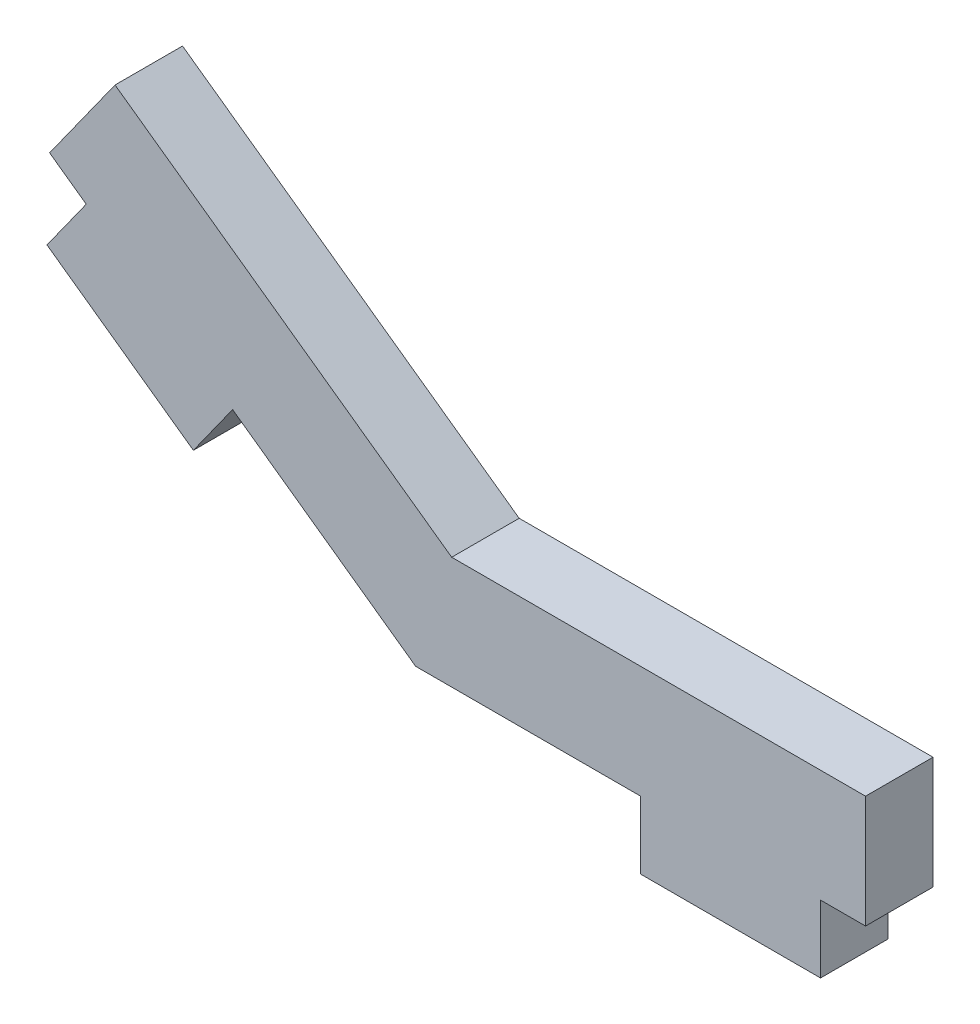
ISO-10303-21;
HEADER;
FILE_DESCRIPTION(('STEP AP214'),'2;1');
FILE_NAME('part.step','',(''),(''),'','','');
FILE_SCHEMA(('AUTOMOTIVE_DESIGN { 1 0 10303 214 1 1 1 1 }'));
ENDSEC;
DATA;
#1=APPLICATION_CONTEXT('core data for automotive mechanical design processes');
#2=APPLICATION_PROTOCOL_DEFINITION('international standard','automotive_design',2000,#1);
#3=PRODUCT_CONTEXT('',#1,'mechanical');
#4=PRODUCT('Part','Part','',(#3));
#5=PRODUCT_RELATED_PRODUCT_CATEGORY('part','',(#4));
#6=PRODUCT_DEFINITION_FORMATION('','',#4);
#7=PRODUCT_DEFINITION_CONTEXT('part definition',#1,'design');
#8=PRODUCT_DEFINITION('design','',#6,#7);
#9=PRODUCT_DEFINITION_SHAPE('','',#8);
#10=(LENGTH_UNIT() NAMED_UNIT(*) SI_UNIT(.MILLI.,.METRE.));
#11=(NAMED_UNIT(*) PLANE_ANGLE_UNIT() SI_UNIT($,.RADIAN.));
#12=(NAMED_UNIT(*) SI_UNIT($,.STERADIAN.) SOLID_ANGLE_UNIT());
#13=UNCERTAINTY_MEASURE_WITH_UNIT(LENGTH_MEASURE(1.E-05),#10,'distance_accuracy_value','');
#14=(GEOMETRIC_REPRESENTATION_CONTEXT(3) GLOBAL_UNCERTAINTY_ASSIGNED_CONTEXT((#13)) GLOBAL_UNIT_ASSIGNED_CONTEXT((#10,
#11,#12)) REPRESENTATION_CONTEXT('',''));
#15=CARTESIAN_POINT('',(0.,0.,0.));
#16=DIRECTION('',(0.,0.,1.));
#17=DIRECTION('',(1.,0.,0.));
#18=AXIS2_PLACEMENT_3D('',#15,#16,#17);
#19=CARTESIAN_POINT('',(0.,0.,3.));
#20=DIRECTION('',(0.581555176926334,0.813506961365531,0.));
#21=DIRECTION('',(-0.813506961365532,0.581555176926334,0.));
#22=AXIS2_PLACEMENT_3D('',#19,#20,#21);
#23=PLANE('',#22);
#24=DIRECTION('',(0.813506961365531,-0.581555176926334,0.));
#25=VECTOR('',#24,1.);
#26=CARTESIAN_POINT('',(0.,0.,0.));
#27=LINE('',#26,#25);
#28=CARTESIAN_POINT('',(-16.2701392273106,11.6311035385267,0.));
#29=VERTEX_POINT('',#28);
#30=CARTESIAN_POINT('',(-14.6431253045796,10.467993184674,0.));
#31=VERTEX_POINT('',#30);
#32=EDGE_CURVE('E215',#29,#31,#27,.T.);
#33=ORIENTED_EDGE('',*,*,#32,.T.);
#34=DIRECTION('',(0.,0.,1.));
#35=VECTOR('',#34,1.);
#36=CARTESIAN_POINT('',(-14.6431253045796,10.467993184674,0.));
#37=LINE('',#36,#35);
#38=CARTESIAN_POINT('',(-14.6431253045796,10.467993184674,3.));
#39=VERTEX_POINT('',#38);
#40=EDGE_CURVE('E58',#31,#39,#37,.T.);
#41=ORIENTED_EDGE('',*,*,#40,.T.);
#42=DIRECTION('',(0.813506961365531,-0.581555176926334,0.));
#43=VECTOR('',#42,1.);
#44=CARTESIAN_POINT('',(0.,0.,3.));
#45=LINE('',#44,#43);
#46=CARTESIAN_POINT('',(-16.2701392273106,11.6311035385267,3.));
#47=VERTEX_POINT('',#46);
#48=EDGE_CURVE('E200',#47,#39,#45,.T.);
#49=ORIENTED_EDGE('',*,*,#48,.F.);
#50=DIRECTION('',(0.,0.,-1.));
#51=VECTOR('',#50,1.);
#52=CARTESIAN_POINT('',(-16.2701392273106,11.6311035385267,3.));
#53=LINE('',#52,#51);
#54=EDGE_CURVE('E214',#47,#29,#53,.T.);
#55=ORIENTED_EDGE('',*,*,#54,.T.);
#56=EDGE_LOOP('',(#33,#41,#49,#55));
#57=FACE_BOUND('',#56,.T.);
#58=ADVANCED_FACE('F35',(#57),#23,.F.);
#59=CARTESIAN_POINT('',(0.,0.,3.));
#60=DIRECTION('',(0.,1.,0.));
#61=DIRECTION('',(0.,0.,1.));
#62=AXIS2_PLACEMENT_3D('',#59,#60,#61);
#63=PLANE('',#62);
#64=DIRECTION('',(0.,0.,1.));
#65=VECTOR('',#64,1.);
#66=CARTESIAN_POINT('',(18.,0.,0.));
#67=LINE('',#66,#65);
#68=CARTESIAN_POINT('',(18.,0.,0.));
#69=VERTEX_POINT('',#68);
#70=CARTESIAN_POINT('',(18.,0.,3.));
#71=VERTEX_POINT('',#70);
#72=EDGE_CURVE('E195',#69,#71,#67,.T.);
#73=ORIENTED_EDGE('',*,*,#72,.F.);
#74=DIRECTION('',(1.,0.,0.));
#75=VECTOR('',#74,1.);
#76=CARTESIAN_POINT('',(0.,0.,0.));
#77=LINE('',#76,#75);
#78=CARTESIAN_POINT('',(20.,0.,0.));
#79=VERTEX_POINT('',#78);
#80=EDGE_CURVE('E217',#69,#79,#77,.T.);
#81=ORIENTED_EDGE('',*,*,#80,.T.);
#82=DIRECTION('',(0.,0.,-1.));
#83=VECTOR('',#82,1.);
#84=CARTESIAN_POINT('',(20.,0.,3.));
#85=LINE('',#84,#83);
#86=CARTESIAN_POINT('',(20.,0.,3.));
#87=VERTEX_POINT('',#86);
#88=EDGE_CURVE('E43',#87,#79,#85,.T.);
#89=ORIENTED_EDGE('',*,*,#88,.F.);
#90=DIRECTION('',(1.,0.,0.));
#91=VECTOR('',#90,1.);
#92=CARTESIAN_POINT('',(0.,0.,3.));
#93=LINE('',#92,#91);
#94=EDGE_CURVE('E202',#71,#87,#93,.T.);
#95=ORIENTED_EDGE('',*,*,#94,.F.);
#96=EDGE_LOOP('',(#73,#81,#89,#95));
#97=FACE_BOUND('',#96,.T.);
#98=ADVANCED_FACE('F267',(#97),#63,.F.);
#99=CARTESIAN_POINT('',(-8.13506961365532,5.81555176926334,3.));
#100=VERTEX_POINT('',#99);
#101=CARTESIAN_POINT('',(0.,0.,3.));
#102=VERTEX_POINT('',#101);
#103=EDGE_CURVE('E50',#100,#102,#45,.T.);
#104=ORIENTED_EDGE('',*,*,#103,.F.);
#105=DIRECTION('',(0.,0.,1.));
#106=VECTOR('',#105,1.);
#107=CARTESIAN_POINT('',(-8.13506961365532,5.81555176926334,0.));
#108=LINE('',#107,#106);
#109=CARTESIAN_POINT('',(-8.13506961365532,5.81555176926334,0.));
#110=VERTEX_POINT('',#109);
#111=EDGE_CURVE('E171',#110,#100,#108,.T.);
#112=ORIENTED_EDGE('',*,*,#111,.F.);
#113=CARTESIAN_POINT('',(0.,0.,0.));
#114=VERTEX_POINT('',#113);
#115=EDGE_CURVE('E194',#110,#114,#27,.T.);
#116=ORIENTED_EDGE('',*,*,#115,.T.);
#117=DIRECTION('',(0.,0.,-1.));
#118=VECTOR('',#117,1.);
#119=CARTESIAN_POINT('',(0.,0.,3.));
#120=LINE('',#119,#118);
#121=EDGE_CURVE('E11',#102,#114,#120,.T.);
#122=ORIENTED_EDGE('',*,*,#121,.F.);
#123=EDGE_LOOP('',(#104,#112,#116,#122));
#124=FACE_BOUND('',#123,.T.);
#125=ADVANCED_FACE('F37',(#124),#23,.F.);
#126=CARTESIAN_POINT('',(10.,0.,0.));
#127=VERTEX_POINT('',#126);
#128=EDGE_CURVE('E218',#114,#127,#77,.T.);
#129=ORIENTED_EDGE('',*,*,#128,.T.);
#130=DIRECTION('',(0.,0.,1.));
#131=VECTOR('',#130,1.);
#132=CARTESIAN_POINT('',(10.,0.,0.));
#133=LINE('',#132,#131);
#134=CARTESIAN_POINT('',(10.,0.,3.));
#135=VERTEX_POINT('',#134);
#136=EDGE_CURVE('E191',#127,#135,#133,.T.);
#137=ORIENTED_EDGE('',*,*,#136,.T.);
#138=EDGE_CURVE('E203',#102,#135,#93,.T.);
#139=ORIENTED_EDGE('',*,*,#138,.F.);
#140=ORIENTED_EDGE('',*,*,#121,.T.);
#141=EDGE_LOOP('',(#129,#137,#139,#140));
#142=FACE_BOUND('',#141,.T.);
#143=ADVANCED_FACE('F279',(#142),#63,.F.);
#144=CARTESIAN_POINT('',(20.,5.,3.));
#145=DIRECTION('',(-1.,0.,0.));
#146=DIRECTION('',(0.,0.,1.));
#147=AXIS2_PLACEMENT_3D('',#144,#145,#146);
#148=PLANE('',#147);
#149=DIRECTION('',(0.,1.,0.));
#150=VECTOR('',#149,1.);
#151=CARTESIAN_POINT('',(20.,5.,0.));
#152=LINE('',#151,#150);
#153=CARTESIAN_POINT('',(20.,5.,0.));
#154=VERTEX_POINT('',#153);
#155=EDGE_CURVE('E221',#79,#154,#152,.T.);
#156=ORIENTED_EDGE('',*,*,#155,.T.);
#157=DIRECTION('',(0.,0.,-1.));
#158=VECTOR('',#157,1.);
#159=CARTESIAN_POINT('',(20.,5.,3.));
#160=LINE('',#159,#158);
#161=CARTESIAN_POINT('',(20.,5.,3.));
#162=VERTEX_POINT('',#161);
#163=EDGE_CURVE('E237',#162,#154,#160,.T.);
#164=ORIENTED_EDGE('',*,*,#163,.F.);
#165=DIRECTION('',(0.,1.,0.));
#166=VECTOR('',#165,1.);
#167=CARTESIAN_POINT('',(20.,5.,3.));
#168=LINE('',#167,#166);
#169=EDGE_CURVE('E206',#87,#162,#168,.T.);
#170=ORIENTED_EDGE('',*,*,#169,.F.);
#171=ORIENTED_EDGE('',*,*,#88,.T.);
#172=EDGE_LOOP('',(#156,#164,#170,#171));
#173=FACE_BOUND('',#172,.T.);
#174=ADVANCED_FACE('F244',(#173),#148,.F.);
#175=CARTESIAN_POINT('',(1.60339935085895,5.,3.));
#176=DIRECTION('',(0.,-1.,0.));
#177=DIRECTION('',(0.,0.,-1.));
#178=AXIS2_PLACEMENT_3D('',#175,#176,#177);
#179=PLANE('',#178);
#180=DIRECTION('',(-1.,0.,0.));
#181=VECTOR('',#180,1.);
#182=CARTESIAN_POINT('',(1.60339935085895,5.,0.));
#183=LINE('',#182,#181);
#184=CARTESIAN_POINT('',(1.60339935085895,5.,0.));
#185=VERTEX_POINT('',#184);
#186=EDGE_CURVE('E223',#154,#185,#183,.T.);
#187=ORIENTED_EDGE('',*,*,#186,.T.);
#188=DIRECTION('',(0.,0.,-1.));
#189=VECTOR('',#188,1.);
#190=CARTESIAN_POINT('',(1.60339935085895,5.,3.));
#191=LINE('',#190,#189);
#192=CARTESIAN_POINT('',(1.60339935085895,5.,3.));
#193=VERTEX_POINT('',#192);
#194=EDGE_CURVE('E234',#193,#185,#191,.T.);
#195=ORIENTED_EDGE('',*,*,#194,.F.);
#196=DIRECTION('',(-1.,0.,0.));
#197=VECTOR('',#196,1.);
#198=CARTESIAN_POINT('',(1.60339935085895,5.,3.));
#199=LINE('',#198,#197);
#200=EDGE_CURVE('E208',#162,#193,#199,.T.);
#201=ORIENTED_EDGE('',*,*,#200,.F.);
#202=ORIENTED_EDGE('',*,*,#163,.T.);
#203=EDGE_LOOP('',(#187,#195,#201,#202));
#204=FACE_BOUND('',#203,.T.);
#205=ADVANCED_FACE('F255',(#204),#179,.F.);
#206=CARTESIAN_POINT('',(-13.362363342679,15.6986383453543,3.));
#207=DIRECTION('',(-0.581555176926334,-0.813506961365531,0.));
#208=DIRECTION('',(0.813506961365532,-0.581555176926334,0.));
#209=AXIS2_PLACEMENT_3D('',#206,#207,#208);
#210=PLANE('',#209);
#211=DIRECTION('',(-0.813506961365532,0.581555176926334,0.));
#212=VECTOR('',#211,1.);
#213=CARTESIAN_POINT('',(-13.362363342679,15.6986383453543,0.));
#214=LINE('',#213,#212);
#215=CARTESIAN_POINT('',(-13.362363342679,15.6986383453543,0.));
#216=VERTEX_POINT('',#215);
#217=EDGE_CURVE('E225',#185,#216,#214,.T.);
#218=ORIENTED_EDGE('',*,*,#217,.T.);
#219=DIRECTION('',(0.,0.,-1.));
#220=VECTOR('',#219,1.);
#221=CARTESIAN_POINT('',(-13.362363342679,15.6986383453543,3.));
#222=LINE('',#221,#220);
#223=CARTESIAN_POINT('',(-13.362363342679,15.6986383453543,3.));
#224=VERTEX_POINT('',#223);
#225=EDGE_CURVE('E231',#224,#216,#222,.T.);
#226=ORIENTED_EDGE('',*,*,#225,.F.);
#227=DIRECTION('',(-0.813506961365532,0.581555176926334,0.));
#228=VECTOR('',#227,1.);
#229=CARTESIAN_POINT('',(-13.362363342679,15.6986383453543,3.));
#230=LINE('',#229,#228);
#231=EDGE_CURVE('E210',#193,#224,#230,.T.);
#232=ORIENTED_EDGE('',*,*,#231,.F.);
#233=ORIENTED_EDGE('',*,*,#194,.T.);
#234=EDGE_LOOP('',(#218,#226,#232,#233));
#235=FACE_BOUND('',#234,.T.);
#236=ADVANCED_FACE('F259',(#235),#210,.F.);
#237=CARTESIAN_POINT('',(-16.2701392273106,11.6311035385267,3.));
#238=DIRECTION('',(0.813506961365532,-0.581555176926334,0.));
#239=DIRECTION('',(0.581555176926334,0.813506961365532,0.));
#240=AXIS2_PLACEMENT_3D('',#237,#238,#239);
#241=PLANE('',#240);
#242=DIRECTION('',(-0.581555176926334,-0.813506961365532,0.));
#243=VECTOR('',#242,1.);
#244=CARTESIAN_POINT('',(-16.2701392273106,11.6311035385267,0.));
#245=LINE('',#244,#243);
#246=EDGE_CURVE('E227',#216,#29,#245,.T.);
#247=ORIENTED_EDGE('',*,*,#246,.T.);
#248=ORIENTED_EDGE('',*,*,#54,.F.);
#249=DIRECTION('',(-0.581555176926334,-0.813506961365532,0.));
#250=VECTOR('',#249,1.);
#251=CARTESIAN_POINT('',(-16.2701392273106,11.6311035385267,3.));
#252=LINE('',#251,#250);
#253=EDGE_CURVE('E212',#224,#47,#252,.T.);
#254=ORIENTED_EDGE('',*,*,#253,.F.);
#255=ORIENTED_EDGE('',*,*,#225,.T.);
#256=EDGE_LOOP('',(#247,#248,#254,#255));
#257=FACE_BOUND('',#256,.T.);
#258=ADVANCED_FACE('F285',(#257),#241,.F.);
#259=CARTESIAN_POINT('',(0.,0.,3.));
#260=DIRECTION('',(0.,0.,-1.));
#261=DIRECTION('',(-1.,0.,0.));
#262=AXIS2_PLACEMENT_3D('',#259,#260,#261);
#263=PLANE('',#262);
#264=ORIENTED_EDGE('',*,*,#48,.T.);
#265=DIRECTION('',(-0.581555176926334,-0.813506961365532,0.));
#266=VECTOR('',#265,1.);
#267=CARTESIAN_POINT('',(-14.6431253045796,10.467993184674,3.));
#268=LINE('',#267,#266);
#269=CARTESIAN_POINT('',(-16.3877908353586,8.02747230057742,3.));
#270=VERTEX_POINT('',#269);
#271=EDGE_CURVE('E166',#39,#270,#268,.T.);
#272=ORIENTED_EDGE('',*,*,#271,.T.);
#273=DIRECTION('',(0.813506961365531,-0.581555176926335,0.));
#274=VECTOR('',#273,1.);
#275=CARTESIAN_POINT('',(-16.3877908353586,8.02747230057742,3.));
#276=LINE('',#275,#274);
#277=CARTESIAN_POINT('',(-9.87973514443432,3.37503088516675,3.));
#278=VERTEX_POINT('',#277);
#279=EDGE_CURVE('E143',#270,#278,#276,.T.);
#280=ORIENTED_EDGE('',*,*,#279,.T.);
#281=DIRECTION('',(0.581555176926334,0.813506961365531,0.));
#282=VECTOR('',#281,1.);
#283=CARTESIAN_POINT('',(-8.13506961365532,5.81555176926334,3.));
#284=LINE('',#283,#282);
#285=EDGE_CURVE('E160',#278,#100,#284,.T.);
#286=ORIENTED_EDGE('',*,*,#285,.T.);
#287=ORIENTED_EDGE('',*,*,#103,.T.);
#288=ORIENTED_EDGE('',*,*,#138,.T.);
#289=DIRECTION('',(0.,-1.,0.));
#290=VECTOR('',#289,1.);
#291=CARTESIAN_POINT('',(10.,0.,3.));
#292=LINE('',#291,#290);
#293=CARTESIAN_POINT('',(10.,-3.,3.));
#294=VERTEX_POINT('',#293);
#295=EDGE_CURVE('E170',#135,#294,#292,.T.);
#296=ORIENTED_EDGE('',*,*,#295,.T.);
#297=DIRECTION('',(1.,0.,0.));
#298=VECTOR('',#297,1.);
#299=CARTESIAN_POINT('',(10.,-3.,3.));
#300=LINE('',#299,#298);
#301=CARTESIAN_POINT('',(18.,-3.,3.));
#302=VERTEX_POINT('',#301);
#303=EDGE_CURVE('E186',#294,#302,#300,.T.);
#304=ORIENTED_EDGE('',*,*,#303,.T.);
#305=DIRECTION('',(0.,1.,0.));
#306=VECTOR('',#305,1.);
#307=CARTESIAN_POINT('',(18.,0.,3.));
#308=LINE('',#307,#306);
#309=EDGE_CURVE('E178',#302,#71,#308,.T.);
#310=ORIENTED_EDGE('',*,*,#309,.T.);
#311=ORIENTED_EDGE('',*,*,#94,.T.);
#312=ORIENTED_EDGE('',*,*,#169,.T.);
#313=ORIENTED_EDGE('',*,*,#200,.T.);
#314=ORIENTED_EDGE('',*,*,#231,.T.);
#315=ORIENTED_EDGE('',*,*,#253,.T.);
#316=EDGE_LOOP('',(#264,#272,#280,#286,#287,#288,#296,#304,#310,#311,#312,#313,#314,#315));
#317=FACE_BOUND('',#316,.T.);
#318=ADVANCED_FACE('F263',(#317),#263,.F.);
#319=CARTESIAN_POINT('',(0.,0.,0.));
#320=DIRECTION('',(0.,0.,-1.));
#321=DIRECTION('',(-1.,0.,0.));
#322=AXIS2_PLACEMENT_3D('',#319,#320,#321);
#323=PLANE('',#322);
#324=ORIENTED_EDGE('',*,*,#32,.F.);
#325=ORIENTED_EDGE('',*,*,#246,.F.);
#326=ORIENTED_EDGE('',*,*,#217,.F.);
#327=ORIENTED_EDGE('',*,*,#186,.F.);
#328=ORIENTED_EDGE('',*,*,#155,.F.);
#329=ORIENTED_EDGE('',*,*,#80,.F.);
#330=DIRECTION('',(0.,1.,0.));
#331=VECTOR('',#330,1.);
#332=CARTESIAN_POINT('',(18.,0.,0.));
#333=LINE('',#332,#331);
#334=CARTESIAN_POINT('',(18.,-3.,0.));
#335=VERTEX_POINT('',#334);
#336=EDGE_CURVE('E181',#335,#69,#333,.T.);
#337=ORIENTED_EDGE('',*,*,#336,.F.);
#338=DIRECTION('',(1.,0.,0.));
#339=VECTOR('',#338,1.);
#340=CARTESIAN_POINT('',(10.,-3.,0.));
#341=LINE('',#340,#339);
#342=CARTESIAN_POINT('',(10.,-3.,0.));
#343=VERTEX_POINT('',#342);
#344=EDGE_CURVE('E177',#343,#335,#341,.T.);
#345=ORIENTED_EDGE('',*,*,#344,.F.);
#346=DIRECTION('',(0.,-1.,0.));
#347=VECTOR('',#346,1.);
#348=CARTESIAN_POINT('',(10.,0.,0.));
#349=LINE('',#348,#347);
#350=EDGE_CURVE('E174',#127,#343,#349,.T.);
#351=ORIENTED_EDGE('',*,*,#350,.F.);
#352=ORIENTED_EDGE('',*,*,#128,.F.);
#353=ORIENTED_EDGE('',*,*,#115,.F.);
#354=DIRECTION('',(0.581555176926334,0.813506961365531,0.));
#355=VECTOR('',#354,1.);
#356=CARTESIAN_POINT('',(-8.13506961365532,5.81555176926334,0.));
#357=LINE('',#356,#355);
#358=CARTESIAN_POINT('',(-9.87973514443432,3.37503088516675,0.));
#359=VERTEX_POINT('',#358);
#360=EDGE_CURVE('E149',#359,#110,#357,.T.);
#361=ORIENTED_EDGE('',*,*,#360,.F.);
#362=DIRECTION('',(0.813506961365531,-0.581555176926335,0.));
#363=VECTOR('',#362,1.);
#364=CARTESIAN_POINT('',(-16.3877908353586,8.02747230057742,0.));
#365=LINE('',#364,#363);
#366=CARTESIAN_POINT('',(-16.3877908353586,8.02747230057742,0.));
#367=VERTEX_POINT('',#366);
#368=EDGE_CURVE('E141',#367,#359,#365,.T.);
#369=ORIENTED_EDGE('',*,*,#368,.F.);
#370=DIRECTION('',(-0.581555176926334,-0.813506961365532,0.));
#371=VECTOR('',#370,1.);
#372=CARTESIAN_POINT('',(-14.6431253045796,10.467993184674,0.));
#373=LINE('',#372,#371);
#374=EDGE_CURVE('E156',#31,#367,#373,.T.);
#375=ORIENTED_EDGE('',*,*,#374,.F.);
#376=EDGE_LOOP('',(#324,#325,#326,#327,#328,#329,#337,#345,#351,#352,#353,#361,#369,#375));
#377=FACE_BOUND('',#376,.T.);
#378=ADVANCED_FACE('F155',(#377),#323,.T.);
#379=CARTESIAN_POINT('',(10.,0.,0.));
#380=DIRECTION('',(-1.,0.,0.));
#381=DIRECTION('',(0.,0.,1.));
#382=AXIS2_PLACEMENT_3D('',#379,#380,#381);
#383=PLANE('',#382);
#384=ORIENTED_EDGE('',*,*,#295,.F.);
#385=ORIENTED_EDGE('',*,*,#136,.F.);
#386=ORIENTED_EDGE('',*,*,#350,.T.);
#387=DIRECTION('',(0.,0.,1.));
#388=VECTOR('',#387,1.);
#389=CARTESIAN_POINT('',(10.,-3.,0.));
#390=LINE('',#389,#388);
#391=EDGE_CURVE('E183',#343,#294,#390,.T.);
#392=ORIENTED_EDGE('',*,*,#391,.T.);
#393=EDGE_LOOP('',(#384,#385,#386,#392));
#394=FACE_BOUND('',#393,.T.);
#395=ADVANCED_FACE('F276',(#394),#383,.T.);
#396=CARTESIAN_POINT('',(18.,0.,0.));
#397=DIRECTION('',(1.,0.,0.));
#398=DIRECTION('',(0.,0.,-1.));
#399=AXIS2_PLACEMENT_3D('',#396,#397,#398);
#400=PLANE('',#399);
#401=ORIENTED_EDGE('',*,*,#309,.F.);
#402=DIRECTION('',(0.,0.,1.));
#403=VECTOR('',#402,1.);
#404=CARTESIAN_POINT('',(18.,-3.,0.));
#405=LINE('',#404,#403);
#406=EDGE_CURVE('E197',#335,#302,#405,.T.);
#407=ORIENTED_EDGE('',*,*,#406,.F.);
#408=ORIENTED_EDGE('',*,*,#336,.T.);
#409=ORIENTED_EDGE('',*,*,#72,.T.);
#410=EDGE_LOOP('',(#401,#407,#408,#409));
#411=FACE_BOUND('',#410,.T.);
#412=ADVANCED_FACE('F269',(#411),#400,.T.);
#413=CARTESIAN_POINT('',(10.,-3.,0.));
#414=DIRECTION('',(0.,-1.,0.));
#415=DIRECTION('',(0.,0.,-1.));
#416=AXIS2_PLACEMENT_3D('',#413,#414,#415);
#417=PLANE('',#416);
#418=ORIENTED_EDGE('',*,*,#303,.F.);
#419=ORIENTED_EDGE('',*,*,#391,.F.);
#420=ORIENTED_EDGE('',*,*,#344,.T.);
#421=ORIENTED_EDGE('',*,*,#406,.T.);
#422=EDGE_LOOP('',(#418,#419,#420,#421));
#423=FACE_BOUND('',#422,.T.);
#424=ADVANCED_FACE('F274',(#423),#417,.T.);
#425=CARTESIAN_POINT('',(-14.6431253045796,10.467993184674,0.));
#426=DIRECTION('',(-0.813506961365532,0.581555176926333,0.));
#427=DIRECTION('',(-0.581555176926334,-0.813506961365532,0.));
#428=AXIS2_PLACEMENT_3D('',#425,#426,#427);
#429=PLANE('',#428);
#430=ORIENTED_EDGE('',*,*,#271,.F.);
#431=ORIENTED_EDGE('',*,*,#40,.F.);
#432=ORIENTED_EDGE('',*,*,#374,.T.);
#433=DIRECTION('',(0.,0.,1.));
#434=VECTOR('',#433,1.);
#435=CARTESIAN_POINT('',(-16.3877908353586,8.02747230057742,0.));
#436=LINE('',#435,#434);
#437=EDGE_CURVE('E138',#367,#270,#436,.T.);
#438=ORIENTED_EDGE('',*,*,#437,.T.);
#439=EDGE_LOOP('',(#430,#431,#432,#438));
#440=FACE_BOUND('',#439,.T.);
#441=ADVANCED_FACE('F159',(#440),#429,.T.);
#442=CARTESIAN_POINT('',(-8.13506961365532,5.81555176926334,0.));
#443=DIRECTION('',(0.813506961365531,-0.581555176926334,0.));
#444=DIRECTION('',(0.581555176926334,0.813506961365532,0.));
#445=AXIS2_PLACEMENT_3D('',#442,#443,#444);
#446=PLANE('',#445);
#447=ORIENTED_EDGE('',*,*,#285,.F.);
#448=DIRECTION('',(0.,0.,1.));
#449=VECTOR('',#448,1.);
#450=CARTESIAN_POINT('',(-9.87973514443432,3.37503088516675,0.));
#451=LINE('',#450,#449);
#452=EDGE_CURVE('E148',#359,#278,#451,.T.);
#453=ORIENTED_EDGE('',*,*,#452,.F.);
#454=ORIENTED_EDGE('',*,*,#360,.T.);
#455=ORIENTED_EDGE('',*,*,#111,.T.);
#456=EDGE_LOOP('',(#447,#453,#454,#455));
#457=FACE_BOUND('',#456,.T.);
#458=ADVANCED_FACE('F283',(#457),#446,.T.);
#459=CARTESIAN_POINT('',(-16.3877908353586,8.02747230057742,0.));
#460=DIRECTION('',(-0.581555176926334,-0.813506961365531,0.));
#461=DIRECTION('',(0.813506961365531,-0.581555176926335,0.));
#462=AXIS2_PLACEMENT_3D('',#459,#460,#461);
#463=PLANE('',#462);
#464=ORIENTED_EDGE('',*,*,#279,.F.);
#465=ORIENTED_EDGE('',*,*,#437,.F.);
#466=ORIENTED_EDGE('',*,*,#368,.T.);
#467=ORIENTED_EDGE('',*,*,#452,.T.);
#468=EDGE_LOOP('',(#464,#465,#466,#467));
#469=FACE_BOUND('',#468,.T.);
#470=ADVANCED_FACE('F140',(#469),#463,.T.);
#471=CLOSED_SHELL('',(#58,#98,#125,#143,#174,#205,#236,#258,#318,#378,#395,#412,#424,#441,#458,#470));
#472=MANIFOLD_SOLID_BREP('B2',#471);
#473=ADVANCED_BREP_SHAPE_REPRESENTATION('',(#18,#472),#14);
#474=SHAPE_DEFINITION_REPRESENTATION(#9,#473);
ENDSEC;
END-ISO-10303-21;
